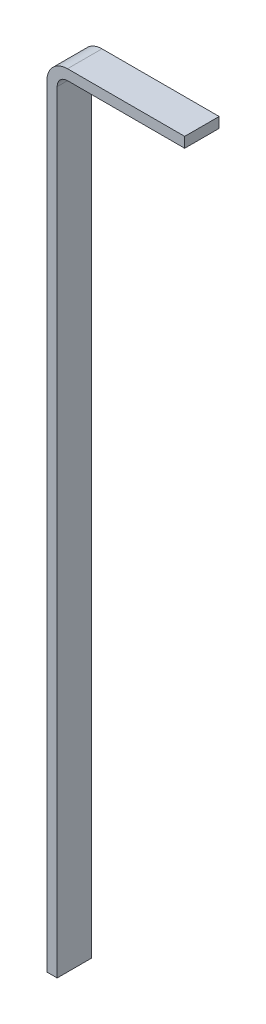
ISO-10303-21;
HEADER;
FILE_DESCRIPTION(('STEP AP214'),'2;1');
FILE_NAME('part.step','',(''),(''),'','','');
FILE_SCHEMA(('AUTOMOTIVE_DESIGN { 1 0 10303 214 1 1 1 1 }'));
ENDSEC;
DATA;
#1=APPLICATION_CONTEXT('core data for automotive mechanical design processes');
#2=APPLICATION_PROTOCOL_DEFINITION('international standard','automotive_design',2000,#1);
#3=PRODUCT_CONTEXT('',#1,'mechanical');
#4=PRODUCT('Part','Part','',(#3));
#5=PRODUCT_RELATED_PRODUCT_CATEGORY('part','',(#4));
#6=PRODUCT_DEFINITION_FORMATION('','',#4);
#7=PRODUCT_DEFINITION_CONTEXT('part definition',#1,'design');
#8=PRODUCT_DEFINITION('design','',#6,#7);
#9=PRODUCT_DEFINITION_SHAPE('','',#8);
#10=(LENGTH_UNIT() NAMED_UNIT(*) SI_UNIT(.MILLI.,.METRE.));
#11=(NAMED_UNIT(*) PLANE_ANGLE_UNIT() SI_UNIT($,.RADIAN.));
#12=(NAMED_UNIT(*) SI_UNIT($,.STERADIAN.) SOLID_ANGLE_UNIT());
#13=UNCERTAINTY_MEASURE_WITH_UNIT(LENGTH_MEASURE(1.E-05),#10,'distance_accuracy_value','');
#14=(GEOMETRIC_REPRESENTATION_CONTEXT(3) GLOBAL_UNCERTAINTY_ASSIGNED_CONTEXT((#13)) GLOBAL_UNIT_ASSIGNED_CONTEXT((#10,
#11,#12)) REPRESENTATION_CONTEXT('',''));
#15=CARTESIAN_POINT('',(0.,0.,0.));
#16=DIRECTION('',(0.,0.,1.));
#17=DIRECTION('',(1.,0.,0.));
#18=AXIS2_PLACEMENT_3D('',#15,#16,#17);
#19=CARTESIAN_POINT('',(68.,12.,20.));
#20=DIRECTION('',(-1.,0.,0.));
#21=DIRECTION('',(0.,0.,1.));
#22=AXIS2_PLACEMENT_3D('',#19,#20,#21);
#23=PLANE('',#22);
#24=DIRECTION('',(0.,1.,0.));
#25=VECTOR('',#24,1.);
#26=CARTESIAN_POINT('',(68.,12.,0.));
#27=LINE('',#26,#25);
#28=CARTESIAN_POINT('',(68.,6.00000000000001,0.));
#29=VERTEX_POINT('',#28);
#30=CARTESIAN_POINT('',(68.,12.,0.));
#31=VERTEX_POINT('',#30);
#32=EDGE_CURVE('E127',#29,#31,#27,.T.);
#33=ORIENTED_EDGE('',*,*,#32,.T.);
#34=DIRECTION('',(0.,0.,-1.));
#35=VECTOR('',#34,1.);
#36=CARTESIAN_POINT('',(68.,12.,20.));
#37=LINE('',#36,#35);
#38=CARTESIAN_POINT('',(68.,12.,20.));
#39=VERTEX_POINT('',#38);
#40=EDGE_CURVE('E11',#39,#31,#37,.T.);
#41=ORIENTED_EDGE('',*,*,#40,.F.);
#42=DIRECTION('',(0.,1.,0.));
#43=VECTOR('',#42,1.);
#44=CARTESIAN_POINT('',(68.,12.,20.));
#45=LINE('',#44,#43);
#46=CARTESIAN_POINT('',(68.,6.00000000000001,20.));
#47=VERTEX_POINT('',#46);
#48=EDGE_CURVE('E141',#47,#39,#45,.T.);
#49=ORIENTED_EDGE('',*,*,#48,.F.);
#50=DIRECTION('',(0.,0.,-1.));
#51=VECTOR('',#50,1.);
#52=CARTESIAN_POINT('',(68.,6.00000000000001,20.));
#53=LINE('',#52,#51);
#54=EDGE_CURVE('E123',#47,#29,#53,.T.);
#55=ORIENTED_EDGE('',*,*,#54,.T.);
#56=EDGE_LOOP('',(#33,#41,#49,#55));
#57=FACE_BOUND('',#56,.T.);
#58=ADVANCED_FACE('F31',(#57),#23,.F.);
#59=CARTESIAN_POINT('',(68.,12.,20.));
#60=DIRECTION('',(0.,-1.,0.));
#61=DIRECTION('',(0.,0.,-1.));
#62=AXIS2_PLACEMENT_3D('',#59,#60,#61);
#63=PLANE('',#62);
#64=DIRECTION('',(-1.,0.,0.));
#65=VECTOR('',#64,1.);
#66=CARTESIAN_POINT('',(68.,12.,0.));
#67=LINE('',#66,#65);
#68=CARTESIAN_POINT('',(0.,12.,0.));
#69=VERTEX_POINT('',#68);
#70=EDGE_CURVE('E130',#31,#69,#67,.T.);
#71=ORIENTED_EDGE('',*,*,#70,.T.);
#72=DIRECTION('',(0.,0.,-1.));
#73=VECTOR('',#72,1.);
#74=CARTESIAN_POINT('',(0.,12.,20.));
#75=LINE('',#74,#73);
#76=CARTESIAN_POINT('',(0.,12.,20.));
#77=VERTEX_POINT('',#76);
#78=EDGE_CURVE('E39',#77,#69,#75,.T.);
#79=ORIENTED_EDGE('',*,*,#78,.F.);
#80=DIRECTION('',(-1.,0.,0.));
#81=VECTOR('',#80,1.);
#82=CARTESIAN_POINT('',(68.,12.,20.));
#83=LINE('',#82,#81);
#84=EDGE_CURVE('E90',#39,#77,#83,.T.);
#85=ORIENTED_EDGE('',*,*,#84,.F.);
#86=ORIENTED_EDGE('',*,*,#40,.T.);
#87=EDGE_LOOP('',(#71,#79,#85,#86));
#88=FACE_BOUND('',#87,.T.);
#89=ADVANCED_FACE('F176',(#88),#63,.F.);
#90=CARTESIAN_POINT('',(0.,0.,20.));
#91=DIRECTION('',(0.,0.,-1.));
#92=DIRECTION('',(-1.,0.,0.));
#93=AXIS2_PLACEMENT_3D('',#90,#91,#92);
#94=CYLINDRICAL_SURFACE('',#93,12.);
#95=CARTESIAN_POINT('',(0.,0.,0.));
#96=DIRECTION('',(0.,0.,1.));
#97=DIRECTION('',(1.,0.,0.));
#98=AXIS2_PLACEMENT_3D('',#95,#96,#97);
#99=CIRCLE('',#98,12.);
#100=CARTESIAN_POINT('',(-12.,0.,0.));
#101=VERTEX_POINT('',#100);
#102=EDGE_CURVE('E132',#69,#101,#99,.T.);
#103=ORIENTED_EDGE('',*,*,#102,.T.);
#104=DIRECTION('',(0.,0.,-1.));
#105=VECTOR('',#104,1.);
#106=CARTESIAN_POINT('',(-12.,0.,20.));
#107=LINE('',#106,#105);
#108=CARTESIAN_POINT('',(-12.,0.,20.));
#109=VERTEX_POINT('',#108);
#110=EDGE_CURVE('E148',#109,#101,#107,.T.);
#111=ORIENTED_EDGE('',*,*,#110,.F.);
#112=CARTESIAN_POINT('',(0.,0.,20.));
#113=DIRECTION('',(0.,0.,1.));
#114=DIRECTION('',(1.,0.,0.));
#115=AXIS2_PLACEMENT_3D('',#112,#113,#114);
#116=CIRCLE('',#115,12.);
#117=EDGE_CURVE('E156',#77,#109,#116,.T.);
#118=ORIENTED_EDGE('',*,*,#117,.F.);
#119=ORIENTED_EDGE('',*,*,#78,.T.);
#120=EDGE_LOOP('',(#103,#111,#118,#119));
#121=FACE_BOUND('',#120,.T.);
#122=ADVANCED_FACE('F154',(#121),#94,.T.);
#123=CARTESIAN_POINT('',(-12.,0.,20.));
#124=DIRECTION('',(1.,0.,0.));
#125=DIRECTION('',(0.,1.,0.));
#126=AXIS2_PLACEMENT_3D('',#123,#124,#125);
#127=PLANE('',#126);
#128=DIRECTION('',(0.,-1.,0.));
#129=VECTOR('',#128,1.);
#130=CARTESIAN_POINT('',(-12.,0.,0.));
#131=LINE('',#130,#129);
#132=CARTESIAN_POINT('',(-11.9999999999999,-448.,0.));
#133=VERTEX_POINT('',#132);
#134=EDGE_CURVE('E134',#101,#133,#131,.T.);
#135=ORIENTED_EDGE('',*,*,#134,.T.);
#136=DIRECTION('',(0.,0.,-1.));
#137=VECTOR('',#136,1.);
#138=CARTESIAN_POINT('',(-11.9999999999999,-448.,20.));
#139=LINE('',#138,#137);
#140=CARTESIAN_POINT('',(-11.9999999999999,-448.,20.));
#141=VERTEX_POINT('',#140);
#142=EDGE_CURVE('E145',#141,#133,#139,.T.);
#143=ORIENTED_EDGE('',*,*,#142,.F.);
#144=DIRECTION('',(0.,-1.,0.));
#145=VECTOR('',#144,1.);
#146=CARTESIAN_POINT('',(-12.,0.,20.));
#147=LINE('',#146,#145);
#148=EDGE_CURVE('E168',#109,#141,#147,.T.);
#149=ORIENTED_EDGE('',*,*,#148,.F.);
#150=ORIENTED_EDGE('',*,*,#110,.T.);
#151=EDGE_LOOP('',(#135,#143,#149,#150));
#152=FACE_BOUND('',#151,.T.);
#153=ADVANCED_FACE('F164',(#152),#127,.F.);
#154=CARTESIAN_POINT('',(-11.9999999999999,-448.,20.));
#155=DIRECTION('',(0.,1.,0.));
#156=DIRECTION('',(0.,0.,1.));
#157=AXIS2_PLACEMENT_3D('',#154,#155,#156);
#158=PLANE('',#157);
#159=DIRECTION('',(1.,0.,0.));
#160=VECTOR('',#159,1.);
#161=CARTESIAN_POINT('',(-11.9999999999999,-448.,0.));
#162=LINE('',#161,#160);
#163=CARTESIAN_POINT('',(-5.99999999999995,-448.,0.));
#164=VERTEX_POINT('',#163);
#165=EDGE_CURVE('E136',#133,#164,#162,.T.);
#166=ORIENTED_EDGE('',*,*,#165,.T.);
#167=DIRECTION('',(0.,0.,-1.));
#168=VECTOR('',#167,1.);
#169=CARTESIAN_POINT('',(-5.99999999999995,-448.,20.));
#170=LINE('',#169,#168);
#171=CARTESIAN_POINT('',(-5.99999999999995,-448.,20.));
#172=VERTEX_POINT('',#171);
#173=EDGE_CURVE('E118',#172,#164,#170,.T.);
#174=ORIENTED_EDGE('',*,*,#173,.F.);
#175=DIRECTION('',(1.,0.,0.));
#176=VECTOR('',#175,1.);
#177=CARTESIAN_POINT('',(-11.9999999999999,-448.,20.));
#178=LINE('',#177,#176);
#179=EDGE_CURVE('E109',#141,#172,#178,.T.);
#180=ORIENTED_EDGE('',*,*,#179,.F.);
#181=ORIENTED_EDGE('',*,*,#142,.T.);
#182=EDGE_LOOP('',(#166,#174,#180,#181));
#183=FACE_BOUND('',#182,.T.);
#184=ADVANCED_FACE('F167',(#183),#158,.F.);
#185=CARTESIAN_POINT('',(-5.99999999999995,-448.,20.));
#186=DIRECTION('',(-1.,0.,0.));
#187=DIRECTION('',(0.,-1.,0.));
#188=AXIS2_PLACEMENT_3D('',#185,#186,#187);
#189=PLANE('',#188);
#190=DIRECTION('',(0.,1.,0.));
#191=VECTOR('',#190,1.);
#192=CARTESIAN_POINT('',(-5.99999999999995,-448.,0.));
#193=LINE('',#192,#191);
#194=CARTESIAN_POINT('',(-6.00000000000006,0.,0.));
#195=VERTEX_POINT('',#194);
#196=EDGE_CURVE('E117',#164,#195,#193,.T.);
#197=ORIENTED_EDGE('',*,*,#196,.T.);
#198=DIRECTION('',(0.,0.,-1.));
#199=VECTOR('',#198,1.);
#200=CARTESIAN_POINT('',(-6.00000000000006,0.,20.));
#201=LINE('',#200,#199);
#202=CARTESIAN_POINT('',(-6.00000000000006,0.,20.));
#203=VERTEX_POINT('',#202);
#204=EDGE_CURVE('E114',#203,#195,#201,.T.);
#205=ORIENTED_EDGE('',*,*,#204,.F.);
#206=DIRECTION('',(0.,1.,0.));
#207=VECTOR('',#206,1.);
#208=CARTESIAN_POINT('',(-5.99999999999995,-448.,20.));
#209=LINE('',#208,#207);
#210=EDGE_CURVE('E103',#172,#203,#209,.T.);
#211=ORIENTED_EDGE('',*,*,#210,.F.);
#212=ORIENTED_EDGE('',*,*,#173,.T.);
#213=EDGE_LOOP('',(#197,#205,#211,#212));
#214=FACE_BOUND('',#213,.T.);
#215=ADVANCED_FACE('F115',(#214),#189,.F.);
#216=CARTESIAN_POINT('',(0.,0.,20.));
#217=DIRECTION('',(0.,0.,-1.));
#218=DIRECTION('',(-1.,0.,0.));
#219=AXIS2_PLACEMENT_3D('',#216,#217,#218);
#220=CYLINDRICAL_SURFACE('',#219,6.);
#221=CARTESIAN_POINT('',(0.,0.,0.));
#222=DIRECTION('',(0.,0.,-1.));
#223=DIRECTION('',(-1.,0.,0.));
#224=AXIS2_PLACEMENT_3D('',#221,#222,#223);
#225=CIRCLE('',#224,6.);
#226=CARTESIAN_POINT('',(0.,6.,0.));
#227=VERTEX_POINT('',#226);
#228=EDGE_CURVE('E76',#195,#227,#225,.T.);
#229=ORIENTED_EDGE('',*,*,#228,.T.);
#230=DIRECTION('',(0.,0.,-1.));
#231=VECTOR('',#230,1.);
#232=CARTESIAN_POINT('',(0.,6.,20.));
#233=LINE('',#232,#231);
#234=CARTESIAN_POINT('',(0.,6.,20.));
#235=VERTEX_POINT('',#234);
#236=EDGE_CURVE('E119',#235,#227,#233,.T.);
#237=ORIENTED_EDGE('',*,*,#236,.F.);
#238=CARTESIAN_POINT('',(0.,0.,20.));
#239=DIRECTION('',(0.,0.,-1.));
#240=DIRECTION('',(-1.,0.,0.));
#241=AXIS2_PLACEMENT_3D('',#238,#239,#240);
#242=CIRCLE('',#241,6.);
#243=EDGE_CURVE('E107',#203,#235,#242,.T.);
#244=ORIENTED_EDGE('',*,*,#243,.F.);
#245=ORIENTED_EDGE('',*,*,#204,.T.);
#246=EDGE_LOOP('',(#229,#237,#244,#245));
#247=FACE_BOUND('',#246,.T.);
#248=ADVANCED_FACE('F121',(#247),#220,.F.);
#249=CARTESIAN_POINT('',(0.,6.00000000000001,20.));
#250=DIRECTION('',(0.,1.,0.));
#251=DIRECTION('',(0.,0.,1.));
#252=AXIS2_PLACEMENT_3D('',#249,#250,#251);
#253=PLANE('',#252);
#254=DIRECTION('',(1.,0.,0.));
#255=VECTOR('',#254,1.);
#256=CARTESIAN_POINT('',(0.,6.00000000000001,0.));
#257=LINE('',#256,#255);
#258=EDGE_CURVE('E82',#227,#29,#257,.T.);
#259=ORIENTED_EDGE('',*,*,#258,.T.);
#260=ORIENTED_EDGE('',*,*,#54,.F.);
#261=DIRECTION('',(1.,0.,0.));
#262=VECTOR('',#261,1.);
#263=CARTESIAN_POINT('',(0.,6.00000000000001,20.));
#264=LINE('',#263,#262);
#265=EDGE_CURVE('E47',#235,#47,#264,.T.);
#266=ORIENTED_EDGE('',*,*,#265,.F.);
#267=ORIENTED_EDGE('',*,*,#236,.T.);
#268=EDGE_LOOP('',(#259,#260,#266,#267));
#269=FACE_BOUND('',#268,.T.);
#270=ADVANCED_FACE('F192',(#269),#253,.F.);
#271=CARTESIAN_POINT('',(0.,0.,20.));
#272=DIRECTION('',(0.,0.,-1.));
#273=DIRECTION('',(-1.,0.,0.));
#274=AXIS2_PLACEMENT_3D('',#271,#272,#273);
#275=PLANE('',#274);
#276=ORIENTED_EDGE('',*,*,#48,.T.);
#277=ORIENTED_EDGE('',*,*,#84,.T.);
#278=ORIENTED_EDGE('',*,*,#117,.T.);
#279=ORIENTED_EDGE('',*,*,#148,.T.);
#280=ORIENTED_EDGE('',*,*,#179,.T.);
#281=ORIENTED_EDGE('',*,*,#210,.T.);
#282=ORIENTED_EDGE('',*,*,#243,.T.);
#283=ORIENTED_EDGE('',*,*,#265,.T.);
#284=EDGE_LOOP('',(#276,#277,#278,#279,#280,#281,#282,#283));
#285=FACE_BOUND('',#284,.T.);
#286=ADVANCED_FACE('F105',(#285),#275,.F.);
#287=CARTESIAN_POINT('',(0.,0.,0.));
#288=DIRECTION('',(0.,0.,-1.));
#289=DIRECTION('',(-1.,0.,0.));
#290=AXIS2_PLACEMENT_3D('',#287,#288,#289);
#291=PLANE('',#290);
#292=ORIENTED_EDGE('',*,*,#32,.F.);
#293=ORIENTED_EDGE('',*,*,#258,.F.);
#294=ORIENTED_EDGE('',*,*,#228,.F.);
#295=ORIENTED_EDGE('',*,*,#196,.F.);
#296=ORIENTED_EDGE('',*,*,#165,.F.);
#297=ORIENTED_EDGE('',*,*,#134,.F.);
#298=ORIENTED_EDGE('',*,*,#102,.F.);
#299=ORIENTED_EDGE('',*,*,#70,.F.);
#300=EDGE_LOOP('',(#292,#293,#294,#295,#296,#297,#298,#299));
#301=FACE_BOUND('',#300,.T.);
#302=ADVANCED_FACE('F160',(#301),#291,.T.);
#303=CLOSED_SHELL('',(#58,#89,#122,#153,#184,#215,#248,#270,#286,#302));
#304=MANIFOLD_SOLID_BREP('B2',#303);
#305=ADVANCED_BREP_SHAPE_REPRESENTATION('',(#18,#304),#14);
#306=SHAPE_DEFINITION_REPRESENTATION(#9,#305);
ENDSEC;
END-ISO-10303-21;
